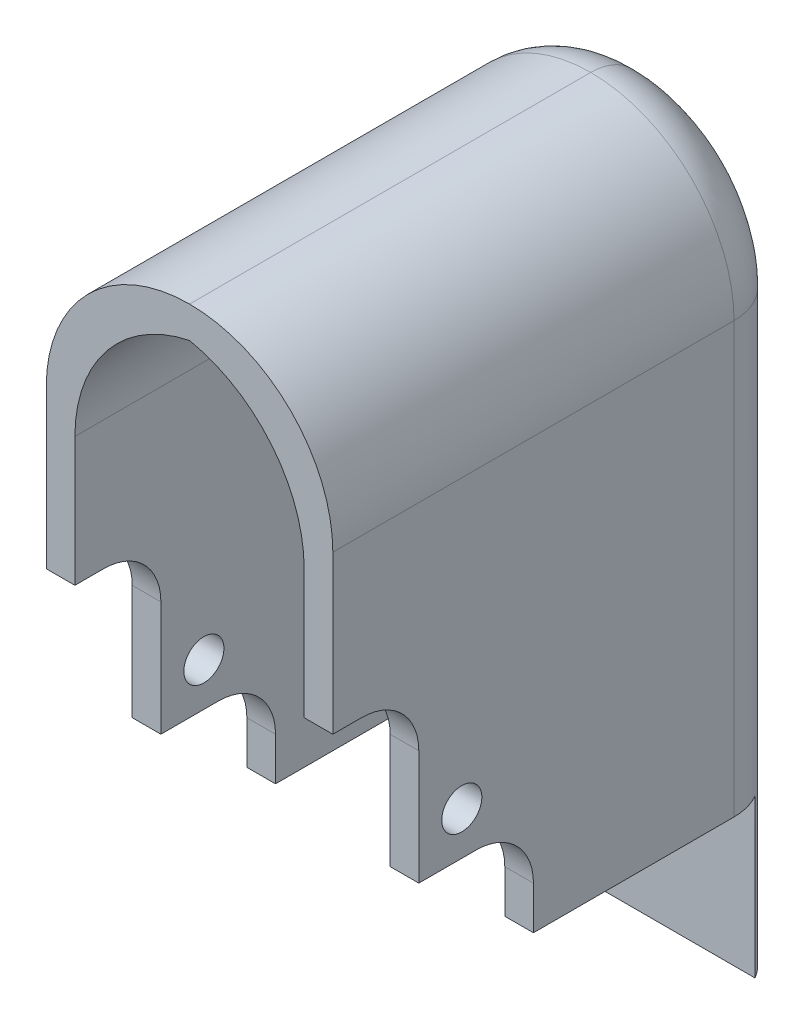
ISO-10303-21;
HEADER;
FILE_DESCRIPTION(('STEP AP214'),'2;1');
FILE_NAME('part.step','',(''),(''),'','','');
FILE_SCHEMA(('AUTOMOTIVE_DESIGN { 1 0 10303 214 1 1 1 1 }'));
ENDSEC;
DATA;
#1=APPLICATION_CONTEXT('core data for automotive mechanical design processes');
#2=APPLICATION_PROTOCOL_DEFINITION('international standard','automotive_design',2000,#1);
#3=PRODUCT_CONTEXT('',#1,'mechanical');
#4=PRODUCT('Part','Part','',(#3));
#5=PRODUCT_RELATED_PRODUCT_CATEGORY('part','',(#4));
#6=PRODUCT_DEFINITION_FORMATION('','',#4);
#7=PRODUCT_DEFINITION_CONTEXT('part definition',#1,'design');
#8=PRODUCT_DEFINITION('design','',#6,#7);
#9=PRODUCT_DEFINITION_SHAPE('','',#8);
#10=(LENGTH_UNIT() NAMED_UNIT(*) SI_UNIT(.MILLI.,.METRE.));
#11=(NAMED_UNIT(*) PLANE_ANGLE_UNIT() SI_UNIT($,.RADIAN.));
#12=(NAMED_UNIT(*) SI_UNIT($,.STERADIAN.) SOLID_ANGLE_UNIT());
#13=UNCERTAINTY_MEASURE_WITH_UNIT(LENGTH_MEASURE(1.E-05),#10,'distance_accuracy_value','');
#14=(GEOMETRIC_REPRESENTATION_CONTEXT(3) GLOBAL_UNCERTAINTY_ASSIGNED_CONTEXT((#13)) GLOBAL_UNIT_ASSIGNED_CONTEXT((#10,
#11,#12)) REPRESENTATION_CONTEXT('',''));
#15=CARTESIAN_POINT('',(0.,0.,0.));
#16=DIRECTION('',(0.,0.,1.));
#17=DIRECTION('',(1.,0.,0.));
#18=AXIS2_PLACEMENT_3D('',#15,#16,#17);
#19=CARTESIAN_POINT('',(0.,0.,-1.));
#20=DIRECTION('',(-1.,0.,0.));
#21=DIRECTION('',(0.,0.,1.));
#22=AXIS2_PLACEMENT_3D('',#19,#20,#21);
#23=PLANE('',#22);
#24=CARTESIAN_POINT('',(0.,9.5,10.5));
#25=DIRECTION('',(-1.,0.,0.));
#26=DIRECTION('',(0.,0.,1.));
#27=AXIS2_PLACEMENT_3D('',#24,#25,#26);
#28=CIRCLE('',#27,0.699999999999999);
#29=CARTESIAN_POINT('',(0.,10.2,10.5));
#30=VERTEX_POINT('',#29);
#31=EDGE_CURVE('E264',#30,#30,#28,.T.);
#32=ORIENTED_EDGE('',*,*,#31,.T.);
#33=EDGE_LOOP('',(#32));
#34=FACE_BOUND('',#33,.T.);
#35=DIRECTION('',(0.,-1.,0.));
#36=VECTOR('',#35,1.);
#37=CARTESIAN_POINT('',(0.,23.5,0.));
#38=LINE('',#37,#36);
#39=CARTESIAN_POINT('',(0.,18.5,0.));
#40=VERTEX_POINT('',#39);
#41=CARTESIAN_POINT('',(0.,4.5,0.));
#42=VERTEX_POINT('',#41);
#43=EDGE_CURVE('E214',#40,#42,#38,.T.);
#44=ORIENTED_EDGE('',*,*,#43,.F.);
#45=DIRECTION('',(0.,0.,1.));
#46=VECTOR('',#45,1.);
#47=CARTESIAN_POINT('',(0.,18.5,15.));
#48=LINE('',#47,#46);
#49=CARTESIAN_POINT('',(0.,18.5,15.));
#50=VERTEX_POINT('',#49);
#51=EDGE_CURVE('E372',#40,#50,#48,.T.);
#52=ORIENTED_EDGE('',*,*,#51,.T.);
#53=DIRECTION('',(0.,1.,0.));
#54=VECTOR('',#53,1.);
#55=CARTESIAN_POINT('',(0.,23.5,15.));
#56=LINE('',#55,#54);
#57=CARTESIAN_POINT('',(0.,14.,15.));
#58=VERTEX_POINT('',#57);
#59=EDGE_CURVE('E321',#58,#50,#56,.T.);
#60=ORIENTED_EDGE('',*,*,#59,.F.);
#61=DIRECTION('',(0.,0.,1.));
#62=VECTOR('',#61,1.);
#63=CARTESIAN_POINT('',(0.,14.,12.));
#64=LINE('',#63,#62);
#65=CARTESIAN_POINT('',(0.,14.,14.));
#66=VERTEX_POINT('',#65);
#67=EDGE_CURVE('E300',#66,#58,#64,.T.);
#68=ORIENTED_EDGE('',*,*,#67,.F.);
#69=CARTESIAN_POINT('',(0.,12.,14.));
#70=DIRECTION('',(-1.,0.,0.));
#71=DIRECTION('',(0.,0.,1.));
#72=AXIS2_PLACEMENT_3D('',#69,#70,#71);
#73=CIRCLE('',#72,2.);
#74=CARTESIAN_POINT('',(0.,12.,12.));
#75=VERTEX_POINT('',#74);
#76=EDGE_CURVE('E366',#66,#75,#73,.T.);
#77=ORIENTED_EDGE('',*,*,#76,.T.);
#78=DIRECTION('',(0.,1.,0.));
#79=VECTOR('',#78,1.);
#80=CARTESIAN_POINT('',(0.,0.,12.));
#81=LINE('',#80,#79);
#82=CARTESIAN_POINT('',(0.,8.,12.));
#83=VERTEX_POINT('',#82);
#84=EDGE_CURVE('E296',#83,#75,#81,.T.);
#85=ORIENTED_EDGE('',*,*,#84,.F.);
#86=DIRECTION('',(0.,0.,1.));
#87=VECTOR('',#86,1.);
#88=CARTESIAN_POINT('',(0.,8.,8.));
#89=LINE('',#88,#87);
#90=CARTESIAN_POINT('',(0.,8.,10.));
#91=VERTEX_POINT('',#90);
#92=EDGE_CURVE('E274',#91,#83,#89,.T.);
#93=ORIENTED_EDGE('',*,*,#92,.F.);
#94=CARTESIAN_POINT('',(0.,6.,10.));
#95=DIRECTION('',(-1.,0.,0.));
#96=DIRECTION('',(0.,0.,1.));
#97=AXIS2_PLACEMENT_3D('',#94,#95,#96);
#98=CIRCLE('',#97,2.);
#99=CARTESIAN_POINT('',(0.,6.,8.));
#100=VERTEX_POINT('',#99);
#101=EDGE_CURVE('E370',#91,#100,#98,.T.);
#102=ORIENTED_EDGE('',*,*,#101,.T.);
#103=DIRECTION('',(0.,1.,0.));
#104=VECTOR('',#103,1.);
#105=CARTESIAN_POINT('',(0.,0.,8.));
#106=LINE('',#105,#104);
#107=CARTESIAN_POINT('',(0.,4.5,8.));
#108=VERTEX_POINT('',#107);
#109=EDGE_CURVE('E239',#108,#100,#106,.T.);
#110=ORIENTED_EDGE('',*,*,#109,.F.);
#111=DIRECTION('',(0.,0.,1.));
#112=VECTOR('',#111,1.);
#113=CARTESIAN_POINT('',(0.,4.5,0.));
#114=LINE('',#113,#112);
#115=EDGE_CURVE('E232',#42,#108,#114,.T.);
#116=ORIENTED_EDGE('',*,*,#115,.F.);
#117=EDGE_LOOP('',(#44,#52,#60,#68,#77,#85,#93,#102,#110,#116));
#118=FACE_BOUND('',#117,.T.);
#119=ADVANCED_FACE('F35',(#34,#118),#23,.F.);
#120=CARTESIAN_POINT('',(8.,0.,-1.));
#121=DIRECTION('',(1.,0.,0.));
#122=DIRECTION('',(0.,0.,-1.));
#123=AXIS2_PLACEMENT_3D('',#120,#121,#122);
#124=PLANE('',#123);
#125=CARTESIAN_POINT('',(8.,9.5,10.5));
#126=DIRECTION('',(1.,0.,0.));
#127=DIRECTION('',(0.,0.,-1.));
#128=AXIS2_PLACEMENT_3D('',#125,#126,#127);
#129=CIRCLE('',#128,0.699999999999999);
#130=CARTESIAN_POINT('',(8.,10.2,10.5));
#131=VERTEX_POINT('',#130);
#132=EDGE_CURVE('E259',#131,#131,#129,.T.);
#133=ORIENTED_EDGE('',*,*,#132,.T.);
#134=EDGE_LOOP('',(#133));
#135=FACE_BOUND('',#134,.T.);
#136=DIRECTION('',(0.,-1.,0.));
#137=VECTOR('',#136,1.);
#138=CARTESIAN_POINT('',(8.,0.,15.));
#139=LINE('',#138,#137);
#140=CARTESIAN_POINT('',(8.,18.5,15.));
#141=VERTEX_POINT('',#140);
#142=CARTESIAN_POINT('',(8.,14.,15.));
#143=VERTEX_POINT('',#142);
#144=EDGE_CURVE('E324',#141,#143,#139,.T.);
#145=ORIENTED_EDGE('',*,*,#144,.F.);
#146=DIRECTION('',(0.,0.,1.));
#147=VECTOR('',#146,1.);
#148=CARTESIAN_POINT('',(8.,18.5,0.));
#149=LINE('',#148,#147);
#150=CARTESIAN_POINT('',(8.,18.5,0.));
#151=VERTEX_POINT('',#150);
#152=EDGE_CURVE('E377',#141,#151,#149,.F.);
#153=ORIENTED_EDGE('',*,*,#152,.T.);
#154=DIRECTION('',(0.,-1.,0.));
#155=VECTOR('',#154,1.);
#156=CARTESIAN_POINT('',(8.,23.5,0.));
#157=LINE('',#156,#155);
#158=CARTESIAN_POINT('',(8.,4.5,0.));
#159=VERTEX_POINT('',#158);
#160=EDGE_CURVE('E226',#151,#159,#157,.T.);
#161=ORIENTED_EDGE('',*,*,#160,.T.);
#162=DIRECTION('',(0.,0.,1.));
#163=VECTOR('',#162,1.);
#164=CARTESIAN_POINT('',(8.,4.5,0.));
#165=LINE('',#164,#163);
#166=CARTESIAN_POINT('',(8.,4.5,8.));
#167=VERTEX_POINT('',#166);
#168=EDGE_CURVE('E252',#159,#167,#165,.T.);
#169=ORIENTED_EDGE('',*,*,#168,.T.);
#170=DIRECTION('',(0.,-1.,0.));
#171=VECTOR('',#170,1.);
#172=CARTESIAN_POINT('',(8.,0.,8.));
#173=LINE('',#172,#171);
#174=CARTESIAN_POINT('',(8.,6.,8.));
#175=VERTEX_POINT('',#174);
#176=EDGE_CURVE('E284',#175,#167,#173,.T.);
#177=ORIENTED_EDGE('',*,*,#176,.F.);
#178=CARTESIAN_POINT('',(8.,6.,10.));
#179=DIRECTION('',(1.,0.,0.));
#180=DIRECTION('',(0.,0.,-1.));
#181=AXIS2_PLACEMENT_3D('',#178,#179,#180);
#182=CIRCLE('',#181,2.);
#183=CARTESIAN_POINT('',(8.,8.,10.));
#184=VERTEX_POINT('',#183);
#185=EDGE_CURVE('E355',#175,#184,#182,.T.);
#186=ORIENTED_EDGE('',*,*,#185,.T.);
#187=DIRECTION('',(0.,0.,1.));
#188=VECTOR('',#187,1.);
#189=CARTESIAN_POINT('',(8.,8.,8.));
#190=LINE('',#189,#188);
#191=CARTESIAN_POINT('',(8.,8.,12.));
#192=VERTEX_POINT('',#191);
#193=EDGE_CURVE('E277',#184,#192,#190,.T.);
#194=ORIENTED_EDGE('',*,*,#193,.T.);
#195=DIRECTION('',(0.,-1.,0.));
#196=VECTOR('',#195,1.);
#197=CARTESIAN_POINT('',(8.,0.,12.));
#198=LINE('',#197,#196);
#199=CARTESIAN_POINT('',(8.,12.,12.));
#200=VERTEX_POINT('',#199);
#201=EDGE_CURVE('E312',#200,#192,#198,.T.);
#202=ORIENTED_EDGE('',*,*,#201,.F.);
#203=CARTESIAN_POINT('',(8.,12.,14.));
#204=DIRECTION('',(1.,0.,0.));
#205=DIRECTION('',(0.,0.,-1.));
#206=AXIS2_PLACEMENT_3D('',#203,#204,#205);
#207=CIRCLE('',#206,2.);
#208=CARTESIAN_POINT('',(8.,14.,14.));
#209=VERTEX_POINT('',#208);
#210=EDGE_CURVE('E360',#200,#209,#207,.T.);
#211=ORIENTED_EDGE('',*,*,#210,.T.);
#212=DIRECTION('',(0.,0.,1.));
#213=VECTOR('',#212,1.);
#214=CARTESIAN_POINT('',(8.,14.,12.));
#215=LINE('',#214,#213);
#216=EDGE_CURVE('E303',#209,#143,#215,.T.);
#217=ORIENTED_EDGE('',*,*,#216,.T.);
#218=EDGE_LOOP('',(#145,#153,#161,#169,#177,#186,#194,#202,#211,#217));
#219=FACE_BOUND('',#218,.T.);
#220=ADVANCED_FACE('F508',(#135,#219),#124,.F.);
#221=CARTESIAN_POINT('',(-1.,24.5,-1.));
#222=DIRECTION('',(-1.,0.,0.));
#223=DIRECTION('',(0.,-1.,0.));
#224=AXIS2_PLACEMENT_3D('',#221,#222,#223);
#225=PLANE('',#224);
#226=DIRECTION('',(0.,0.,1.));
#227=VECTOR('',#226,1.);
#228=CARTESIAN_POINT('',(-0.999999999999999,19.5,-1.));
#229=LINE('',#228,#227);
#230=CARTESIAN_POINT('',(-0.999999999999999,19.5,15.));
#231=VERTEX_POINT('',#230);
#232=CARTESIAN_POINT('',(-0.999999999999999,19.5,1.));
#233=VERTEX_POINT('',#232);
#234=EDGE_CURVE('E379',#231,#233,#229,.F.);
#235=ORIENTED_EDGE('',*,*,#234,.T.);
#236=DIRECTION('',(0.,-1.,0.));
#237=VECTOR('',#236,1.);
#238=CARTESIAN_POINT('',(-0.999999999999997,-1.,1.));
#239=LINE('',#238,#237);
#240=CARTESIAN_POINT('',(-0.999999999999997,4.5,1.));
#241=VERTEX_POINT('',#240);
#242=EDGE_CURVE('E392',#233,#241,#239,.T.);
#243=ORIENTED_EDGE('',*,*,#242,.T.);
#244=DIRECTION('',(0.,0.,1.));
#245=VECTOR('',#244,1.);
#246=CARTESIAN_POINT('',(-0.999999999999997,4.5,0.));
#247=LINE('',#246,#245);
#248=CARTESIAN_POINT('',(-0.999999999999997,4.5,8.));
#249=VERTEX_POINT('',#248);
#250=EDGE_CURVE('E240',#241,#249,#247,.T.);
#251=ORIENTED_EDGE('',*,*,#250,.T.);
#252=DIRECTION('',(0.,-1.,0.));
#253=VECTOR('',#252,1.);
#254=CARTESIAN_POINT('',(-0.999999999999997,0.,8.));
#255=LINE('',#254,#253);
#256=CARTESIAN_POINT('',(-0.999999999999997,6.,8.));
#257=VERTEX_POINT('',#256);
#258=EDGE_CURVE('E269',#257,#249,#255,.T.);
#259=ORIENTED_EDGE('',*,*,#258,.F.);
#260=CARTESIAN_POINT('',(-0.999999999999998,6.,10.));
#261=DIRECTION('',(-1.,0.,0.));
#262=DIRECTION('',(0.,-1.,0.));
#263=AXIS2_PLACEMENT_3D('',#260,#261,#262);
#264=CIRCLE('',#263,2.);
#265=CARTESIAN_POINT('',(-0.999999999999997,8.,10.));
#266=VERTEX_POINT('',#265);
#267=EDGE_CURVE('E368',#257,#266,#264,.F.);
#268=ORIENTED_EDGE('',*,*,#267,.T.);
#269=DIRECTION('',(0.,0.,1.));
#270=VECTOR('',#269,1.);
#271=CARTESIAN_POINT('',(-0.999999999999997,8.,8.));
#272=LINE('',#271,#270);
#273=CARTESIAN_POINT('',(-0.999999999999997,8.,12.));
#274=VERTEX_POINT('',#273);
#275=EDGE_CURVE('E278',#266,#274,#272,.T.);
#276=ORIENTED_EDGE('',*,*,#275,.T.);
#277=DIRECTION('',(0.,-1.,0.));
#278=VECTOR('',#277,1.);
#279=CARTESIAN_POINT('',(-0.999999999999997,0.,12.));
#280=LINE('',#279,#278);
#281=CARTESIAN_POINT('',(-0.999999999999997,12.,12.));
#282=VERTEX_POINT('',#281);
#283=EDGE_CURVE('E293',#282,#274,#280,.T.);
#284=ORIENTED_EDGE('',*,*,#283,.F.);
#285=CARTESIAN_POINT('',(-0.999999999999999,12.,14.));
#286=DIRECTION('',(-1.,0.,0.));
#287=DIRECTION('',(0.,-1.,0.));
#288=AXIS2_PLACEMENT_3D('',#285,#286,#287);
#289=CIRCLE('',#288,2.);
#290=CARTESIAN_POINT('',(-0.999999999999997,14.,14.));
#291=VERTEX_POINT('',#290);
#292=EDGE_CURVE('E364',#282,#291,#289,.F.);
#293=ORIENTED_EDGE('',*,*,#292,.T.);
#294=DIRECTION('',(0.,0.,1.));
#295=VECTOR('',#294,1.);
#296=CARTESIAN_POINT('',(-0.999999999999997,14.,12.));
#297=LINE('',#296,#295);
#298=CARTESIAN_POINT('',(-0.999999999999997,14.,15.));
#299=VERTEX_POINT('',#298);
#300=EDGE_CURVE('E304',#291,#299,#297,.T.);
#301=ORIENTED_EDGE('',*,*,#300,.T.);
#302=DIRECTION('',(0.,-1.,0.));
#303=VECTOR('',#302,1.);
#304=CARTESIAN_POINT('',(-1.,24.5,15.));
#305=LINE('',#304,#303);
#306=EDGE_CURVE('E307',#231,#299,#305,.T.);
#307=ORIENTED_EDGE('',*,*,#306,.F.);
#308=EDGE_LOOP('',(#235,#243,#251,#259,#268,#276,#284,#293,#301,#307));
#309=FACE_BOUND('',#308,.T.);
#310=CARTESIAN_POINT('',(-1.,9.5,10.5));
#311=DIRECTION('',(1.,0.,0.));
#312=DIRECTION('',(0.,1.,0.));
#313=AXIS2_PLACEMENT_3D('',#310,#311,#312);
#314=CIRCLE('',#313,0.699999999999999);
#315=CARTESIAN_POINT('',(-1.,10.2,10.5));
#316=VERTEX_POINT('',#315);
#317=EDGE_CURVE('E256',#316,#316,#314,.T.);
#318=ORIENTED_EDGE('',*,*,#317,.T.);
#319=EDGE_LOOP('',(#318));
#320=FACE_BOUND('',#319,.T.);
#321=ADVANCED_FACE('F452',(#309,#320),#225,.T.);
#322=CARTESIAN_POINT('',(9.,24.5,-1.));
#323=DIRECTION('',(1.,0.,0.));
#324=DIRECTION('',(0.,1.,0.));
#325=AXIS2_PLACEMENT_3D('',#322,#323,#324);
#326=PLANE('',#325);
#327=DIRECTION('',(0.,0.,1.));
#328=VECTOR('',#327,1.);
#329=CARTESIAN_POINT('',(9.,4.5,0.));
#330=LINE('',#329,#328);
#331=CARTESIAN_POINT('',(9.,4.5,1.));
#332=VERTEX_POINT('',#331);
#333=CARTESIAN_POINT('',(9.,4.5,8.));
#334=VERTEX_POINT('',#333);
#335=EDGE_CURVE('E248',#332,#334,#330,.T.);
#336=ORIENTED_EDGE('',*,*,#335,.F.);
#337=DIRECTION('',(0.,1.,0.));
#338=VECTOR('',#337,1.);
#339=CARTESIAN_POINT('',(9.,19.5,1.));
#340=LINE('',#339,#338);
#341=CARTESIAN_POINT('',(9.,19.5,1.));
#342=VERTEX_POINT('',#341);
#343=EDGE_CURVE('E416',#332,#342,#340,.T.);
#344=ORIENTED_EDGE('',*,*,#343,.T.);
#345=DIRECTION('',(0.,0.,1.));
#346=VECTOR('',#345,1.);
#347=CARTESIAN_POINT('',(9.,19.5,-1.));
#348=LINE('',#347,#346);
#349=CARTESIAN_POINT('',(9.,19.5,15.));
#350=VERTEX_POINT('',#349);
#351=EDGE_CURVE('E382',#342,#350,#348,.T.);
#352=ORIENTED_EDGE('',*,*,#351,.T.);
#353=DIRECTION('',(0.,1.,0.));
#354=VECTOR('',#353,1.);
#355=CARTESIAN_POINT('',(9.00000000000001,0.,15.));
#356=LINE('',#355,#354);
#357=CARTESIAN_POINT('',(9.,14.,15.));
#358=VERTEX_POINT('',#357);
#359=EDGE_CURVE('E326',#358,#350,#356,.T.);
#360=ORIENTED_EDGE('',*,*,#359,.F.);
#361=DIRECTION('',(0.,0.,1.));
#362=VECTOR('',#361,1.);
#363=CARTESIAN_POINT('',(8.99999999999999,14.,12.));
#364=LINE('',#363,#362);
#365=CARTESIAN_POINT('',(8.99999999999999,14.,14.));
#366=VERTEX_POINT('',#365);
#367=EDGE_CURVE('E314',#366,#358,#364,.T.);
#368=ORIENTED_EDGE('',*,*,#367,.F.);
#369=CARTESIAN_POINT('',(9.,12.,14.));
#370=DIRECTION('',(1.,0.,0.));
#371=DIRECTION('',(0.,1.,0.));
#372=AXIS2_PLACEMENT_3D('',#369,#370,#371);
#373=CIRCLE('',#372,2.);
#374=CARTESIAN_POINT('',(8.99999999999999,12.,12.));
#375=VERTEX_POINT('',#374);
#376=EDGE_CURVE('E362',#366,#375,#373,.F.);
#377=ORIENTED_EDGE('',*,*,#376,.T.);
#378=DIRECTION('',(0.,1.,0.));
#379=VECTOR('',#378,1.);
#380=CARTESIAN_POINT('',(9.,0.,12.));
#381=LINE('',#380,#379);
#382=CARTESIAN_POINT('',(9.,8.,12.));
#383=VERTEX_POINT('',#382);
#384=EDGE_CURVE('E309',#383,#375,#381,.T.);
#385=ORIENTED_EDGE('',*,*,#384,.F.);
#386=DIRECTION('',(0.,0.,1.));
#387=VECTOR('',#386,1.);
#388=CARTESIAN_POINT('',(9.,8.,8.));
#389=LINE('',#388,#387);
#390=CARTESIAN_POINT('',(9.,8.,10.));
#391=VERTEX_POINT('',#390);
#392=EDGE_CURVE('E287',#391,#383,#389,.T.);
#393=ORIENTED_EDGE('',*,*,#392,.F.);
#394=CARTESIAN_POINT('',(9.,6.,10.));
#395=DIRECTION('',(1.,0.,0.));
#396=DIRECTION('',(0.,1.,0.));
#397=AXIS2_PLACEMENT_3D('',#394,#395,#396);
#398=CIRCLE('',#397,2.);
#399=CARTESIAN_POINT('',(9.,6.,8.));
#400=VERTEX_POINT('',#399);
#401=EDGE_CURVE('E357',#391,#400,#398,.F.);
#402=ORIENTED_EDGE('',*,*,#401,.T.);
#403=DIRECTION('',(0.,1.,0.));
#404=VECTOR('',#403,1.);
#405=CARTESIAN_POINT('',(9.,0.,8.));
#406=LINE('',#405,#404);
#407=EDGE_CURVE('E282',#334,#400,#406,.T.);
#408=ORIENTED_EDGE('',*,*,#407,.F.);
#409=EDGE_LOOP('',(#336,#344,#352,#360,#368,#377,#385,#393,#402,#408));
#410=FACE_BOUND('',#409,.T.);
#411=CARTESIAN_POINT('',(9.,9.5,10.5));
#412=DIRECTION('',(1.,0.,0.));
#413=DIRECTION('',(0.,1.,0.));
#414=AXIS2_PLACEMENT_3D('',#411,#412,#413);
#415=CIRCLE('',#414,0.699999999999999);
#416=CARTESIAN_POINT('',(9.,10.2,10.5));
#417=VERTEX_POINT('',#416);
#418=EDGE_CURVE('E242',#417,#417,#415,.T.);
#419=ORIENTED_EDGE('',*,*,#418,.F.);
#420=EDGE_LOOP('',(#419));
#421=FACE_BOUND('',#420,.T.);
#422=ADVANCED_FACE('F495',(#410,#421),#326,.T.);
#423=CARTESIAN_POINT('',(-0.999999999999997,-1.,-1.));
#424=DIRECTION('',(0.,-1.,0.));
#425=DIRECTION('',(0.,0.,-1.));
#426=AXIS2_PLACEMENT_3D('',#423,#424,#425);
#427=PLANE('',#426);
#428=DIRECTION('',(1.,0.,0.));
#429=VECTOR('',#428,1.);
#430=CARTESIAN_POINT('',(-0.999999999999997,-1.,0.));
#431=LINE('',#430,#429);
#432=CARTESIAN_POINT('',(-0.732050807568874,-1.,0.));
#433=VERTEX_POINT('',#432);
#434=CARTESIAN_POINT('',(8.73205080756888,-1.,0.));
#435=VERTEX_POINT('',#434);
#436=EDGE_CURVE('E329',#433,#435,#431,.T.);
#437=ORIENTED_EDGE('',*,*,#436,.F.);
#438=CARTESIAN_POINT('',(1.,-1.,1.));
#439=DIRECTION('',(0.,-1.,0.));
#440=DIRECTION('',(0.,0.,-1.));
#441=AXIS2_PLACEMENT_3D('',#438,#439,#440);
#442=CIRCLE('',#441,2.);
#443=CARTESIAN_POINT('',(1.,-1.,-1.));
#444=VERTEX_POINT('',#443);
#445=EDGE_CURVE('E406',#433,#444,#442,.T.);
#446=ORIENTED_EDGE('',*,*,#445,.T.);
#447=DIRECTION('',(1.,0.,0.));
#448=VECTOR('',#447,1.);
#449=CARTESIAN_POINT('',(-0.999999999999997,-1.,-1.));
#450=LINE('',#449,#448);
#451=CARTESIAN_POINT('',(7.,-1.,-1.));
#452=VERTEX_POINT('',#451);
#453=EDGE_CURVE('E330',#444,#452,#450,.T.);
#454=ORIENTED_EDGE('',*,*,#453,.T.);
#455=CARTESIAN_POINT('',(7.,-1.,1.));
#456=DIRECTION('',(0.,-1.,0.));
#457=DIRECTION('',(0.,0.,-1.));
#458=AXIS2_PLACEMENT_3D('',#455,#456,#457);
#459=CIRCLE('',#458,2.);
#460=EDGE_CURVE('E404',#452,#435,#459,.T.);
#461=ORIENTED_EDGE('',*,*,#460,.T.);
#462=EDGE_LOOP('',(#437,#446,#454,#461));
#463=FACE_BOUND('',#462,.T.);
#464=ADVANCED_FACE('F444',(#463),#427,.T.);
#465=CARTESIAN_POINT('',(0.,0.,-1.));
#466=DIRECTION('',(0.,0.,1.));
#467=DIRECTION('',(1.,0.,0.));
#468=AXIS2_PLACEMENT_3D('',#465,#466,#467);
#469=PLANE('',#468);
#470=ORIENTED_EDGE('',*,*,#453,.F.);
#471=DIRECTION('',(0.,-1.,0.));
#472=VECTOR('',#471,1.);
#473=CARTESIAN_POINT('',(1.,19.5,-1.));
#474=LINE('',#473,#472);
#475=CARTESIAN_POINT('',(1.,19.5,-1.));
#476=VERTEX_POINT('',#475);
#477=EDGE_CURVE('E414',#444,#476,#474,.F.);
#478=ORIENTED_EDGE('',*,*,#477,.T.);
#479=CARTESIAN_POINT('',(4.,19.5,-1.));
#480=DIRECTION('',(0.,0.,1.));
#481=DIRECTION('',(1.,0.,0.));
#482=AXIS2_PLACEMENT_3D('',#479,#480,#481);
#483=CIRCLE('',#482,3.);
#484=CARTESIAN_POINT('',(4.,22.5,-1.));
#485=VERTEX_POINT('',#484);
#486=EDGE_CURVE('E408',#476,#485,#483,.F.);
#487=ORIENTED_EDGE('',*,*,#486,.T.);
#488=CARTESIAN_POINT('',(4.,19.5,-1.));
#489=DIRECTION('',(0.,0.,1.));
#490=DIRECTION('',(1.,0.,0.));
#491=AXIS2_PLACEMENT_3D('',#488,#489,#490);
#492=CIRCLE('',#491,3.);
#493=CARTESIAN_POINT('',(7.,19.5,-1.));
#494=VERTEX_POINT('',#493);
#495=EDGE_CURVE('E410',#485,#494,#492,.F.);
#496=ORIENTED_EDGE('',*,*,#495,.T.);
#497=DIRECTION('',(0.,1.,0.));
#498=VECTOR('',#497,1.);
#499=CARTESIAN_POINT('',(7.,-1.,-1.));
#500=LINE('',#499,#498);
#501=EDGE_CURVE('E412',#494,#452,#500,.F.);
#502=ORIENTED_EDGE('',*,*,#501,.T.);
#503=EDGE_LOOP('',(#470,#478,#487,#496,#502));
#504=FACE_BOUND('',#503,.T.);
#505=ADVANCED_FACE('F440',(#504),#469,.F.);
#506=CARTESIAN_POINT('',(0.,0.,0.));
#507=DIRECTION('',(0.,0.,1.));
#508=DIRECTION('',(1.,0.,0.));
#509=AXIS2_PLACEMENT_3D('',#506,#507,#508);
#510=PLANE('',#509);
#511=DIRECTION('',(-1.,0.,0.));
#512=VECTOR('',#511,1.);
#513=CARTESIAN_POINT('',(-0.999999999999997,4.5,0.));
#514=LINE('',#513,#512);
#515=CARTESIAN_POINT('',(-0.732050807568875,4.5,0.));
#516=VERTEX_POINT('',#515);
#517=EDGE_CURVE('E217',#42,#516,#514,.T.);
#518=ORIENTED_EDGE('',*,*,#517,.T.);
#519=DIRECTION('',(0.,1.,0.));
#520=VECTOR('',#519,1.);
#521=CARTESIAN_POINT('',(-0.732050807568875,4.5,0.));
#522=LINE('',#521,#520);
#523=EDGE_CURVE('E402',#516,#433,#522,.F.);
#524=ORIENTED_EDGE('',*,*,#523,.T.);
#525=ORIENTED_EDGE('',*,*,#436,.T.);
#526=DIRECTION('',(0.,-1.,0.));
#527=VECTOR('',#526,1.);
#528=CARTESIAN_POINT('',(8.73205080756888,-1.,0.));
#529=LINE('',#528,#527);
#530=CARTESIAN_POINT('',(8.73205080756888,4.5,0.));
#531=VERTEX_POINT('',#530);
#532=EDGE_CURVE('E400',#435,#531,#529,.F.);
#533=ORIENTED_EDGE('',*,*,#532,.T.);
#534=DIRECTION('',(-1.,0.,0.));
#535=VECTOR('',#534,1.);
#536=CARTESIAN_POINT('',(9.,4.5,0.));
#537=LINE('',#536,#535);
#538=EDGE_CURVE('E246',#531,#159,#537,.T.);
#539=ORIENTED_EDGE('',*,*,#538,.T.);
#540=ORIENTED_EDGE('',*,*,#160,.F.);
#541=CARTESIAN_POINT('',(3.,18.5,0.));
#542=DIRECTION('',(0.,0.,1.));
#543=DIRECTION('',(1.,0.,0.));
#544=AXIS2_PLACEMENT_3D('',#541,#542,#543);
#545=CIRCLE('',#544,5.);
#546=CARTESIAN_POINT('',(4.,23.3989794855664,0.));
#547=VERTEX_POINT('',#546);
#548=EDGE_CURVE('E374',#151,#547,#545,.T.);
#549=ORIENTED_EDGE('',*,*,#548,.T.);
#550=CARTESIAN_POINT('',(5.,18.5,0.));
#551=DIRECTION('',(0.,0.,1.));
#552=DIRECTION('',(1.,0.,0.));
#553=AXIS2_PLACEMENT_3D('',#550,#551,#552);
#554=CIRCLE('',#553,5.);
#555=EDGE_CURVE('E220',#547,#40,#554,.T.);
#556=ORIENTED_EDGE('',*,*,#555,.T.);
#557=ORIENTED_EDGE('',*,*,#43,.T.);
#558=EDGE_LOOP('',(#518,#524,#525,#533,#539,#540,#549,#556,#557));
#559=FACE_BOUND('',#558,.T.);
#560=ADVANCED_FACE('F216',(#559),#510,.T.);
#561=CARTESIAN_POINT('',(0.,0.,15.));
#562=DIRECTION('',(0.,0.,1.));
#563=DIRECTION('',(1.,0.,0.));
#564=AXIS2_PLACEMENT_3D('',#561,#562,#563);
#565=PLANE('',#564);
#566=CARTESIAN_POINT('',(4.,19.5,15.));
#567=DIRECTION('',(0.,0.,1.));
#568=DIRECTION('',(1.,0.,0.));
#569=AXIS2_PLACEMENT_3D('',#566,#567,#568);
#570=CIRCLE('',#569,5.);
#571=CARTESIAN_POINT('',(4.,24.5,15.));
#572=VERTEX_POINT('',#571);
#573=EDGE_CURVE('E388',#350,#572,#570,.T.);
#574=ORIENTED_EDGE('',*,*,#573,.T.);
#575=CARTESIAN_POINT('',(4.,19.5,15.));
#576=DIRECTION('',(0.,0.,1.));
#577=DIRECTION('',(1.,0.,0.));
#578=AXIS2_PLACEMENT_3D('',#575,#576,#577);
#579=CIRCLE('',#578,5.);
#580=EDGE_CURVE('E390',#572,#231,#579,.T.);
#581=ORIENTED_EDGE('',*,*,#580,.T.);
#582=ORIENTED_EDGE('',*,*,#306,.T.);
#583=DIRECTION('',(-1.,0.,0.));
#584=VECTOR('',#583,1.);
#585=CARTESIAN_POINT('',(-0.999999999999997,14.,15.));
#586=LINE('',#585,#584);
#587=EDGE_CURVE('E297',#58,#299,#586,.T.);
#588=ORIENTED_EDGE('',*,*,#587,.F.);
#589=ORIENTED_EDGE('',*,*,#59,.T.);
#590=CARTESIAN_POINT('',(5.,18.5,15.));
#591=DIRECTION('',(0.,0.,1.));
#592=DIRECTION('',(1.,0.,0.));
#593=AXIS2_PLACEMENT_3D('',#590,#591,#592);
#594=CIRCLE('',#593,5.);
#595=CARTESIAN_POINT('',(4.,23.3989794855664,15.));
#596=VERTEX_POINT('',#595);
#597=EDGE_CURVE('E384',#50,#596,#594,.F.);
#598=ORIENTED_EDGE('',*,*,#597,.T.);
#599=CARTESIAN_POINT('',(3.,18.5,15.));
#600=DIRECTION('',(0.,0.,1.));
#601=DIRECTION('',(1.,0.,0.));
#602=AXIS2_PLACEMENT_3D('',#599,#600,#601);
#603=CIRCLE('',#602,5.);
#604=EDGE_CURVE('E386',#596,#141,#603,.F.);
#605=ORIENTED_EDGE('',*,*,#604,.T.);
#606=ORIENTED_EDGE('',*,*,#144,.T.);
#607=DIRECTION('',(-1.,0.,0.));
#608=VECTOR('',#607,1.);
#609=CARTESIAN_POINT('',(8.99999999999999,14.,15.));
#610=LINE('',#609,#608);
#611=EDGE_CURVE('E280',#358,#143,#610,.T.);
#612=ORIENTED_EDGE('',*,*,#611,.F.);
#613=ORIENTED_EDGE('',*,*,#359,.T.);
#614=EDGE_LOOP('',(#574,#581,#582,#588,#589,#598,#605,#606,#612,#613));
#615=FACE_BOUND('',#614,.T.);
#616=ADVANCED_FACE('F485',(#615),#565,.T.);
#617=CARTESIAN_POINT('',(8.99999999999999,14.,12.));
#618=DIRECTION('',(0.,1.,0.));
#619=DIRECTION('',(0.,0.,1.));
#620=AXIS2_PLACEMENT_3D('',#617,#618,#619);
#621=PLANE('',#620);
#622=ORIENTED_EDGE('',*,*,#216,.F.);
#623=DIRECTION('',(-1.,0.,0.));
#624=VECTOR('',#623,1.);
#625=CARTESIAN_POINT('',(8.99999999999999,14.,14.));
#626=LINE('',#625,#624);
#627=EDGE_CURVE('E343',#209,#366,#626,.F.);
#628=ORIENTED_EDGE('',*,*,#627,.T.);
#629=ORIENTED_EDGE('',*,*,#367,.T.);
#630=ORIENTED_EDGE('',*,*,#611,.T.);
#631=EDGE_LOOP('',(#622,#628,#629,#630));
#632=FACE_BOUND('',#631,.T.);
#633=ADVANCED_FACE('F523',(#632),#621,.F.);
#634=CARTESIAN_POINT('',(0.,0.,12.));
#635=DIRECTION('',(0.,0.,1.));
#636=DIRECTION('',(1.,0.,0.));
#637=AXIS2_PLACEMENT_3D('',#634,#635,#636);
#638=PLANE('',#637);
#639=ORIENTED_EDGE('',*,*,#384,.T.);
#640=DIRECTION('',(-1.,0.,0.));
#641=VECTOR('',#640,1.);
#642=CARTESIAN_POINT('',(0.,12.,12.));
#643=LINE('',#642,#641);
#644=EDGE_CURVE('E340',#375,#200,#643,.T.);
#645=ORIENTED_EDGE('',*,*,#644,.T.);
#646=ORIENTED_EDGE('',*,*,#201,.T.);
#647=DIRECTION('',(-1.,0.,0.));
#648=VECTOR('',#647,1.);
#649=CARTESIAN_POINT('',(9.,8.,12.));
#650=LINE('',#649,#648);
#651=EDGE_CURVE('E225',#383,#192,#650,.T.);
#652=ORIENTED_EDGE('',*,*,#651,.F.);
#653=EDGE_LOOP('',(#639,#645,#646,#652));
#654=FACE_BOUND('',#653,.T.);
#655=ADVANCED_FACE('F531',(#654),#638,.T.);
#656=CARTESIAN_POINT('',(-0.999999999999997,14.,12.));
#657=DIRECTION('',(0.,1.,0.));
#658=DIRECTION('',(0.,0.,1.));
#659=AXIS2_PLACEMENT_3D('',#656,#657,#658);
#660=PLANE('',#659);
#661=ORIENTED_EDGE('',*,*,#300,.F.);
#662=DIRECTION('',(-1.,0.,0.));
#663=VECTOR('',#662,1.);
#664=CARTESIAN_POINT('',(0.,14.,14.));
#665=LINE('',#664,#663);
#666=EDGE_CURVE('E348',#291,#66,#665,.F.);
#667=ORIENTED_EDGE('',*,*,#666,.T.);
#668=ORIENTED_EDGE('',*,*,#67,.T.);
#669=ORIENTED_EDGE('',*,*,#587,.T.);
#670=EDGE_LOOP('',(#661,#667,#668,#669));
#671=FACE_BOUND('',#670,.T.);
#672=ADVANCED_FACE('F478',(#671),#660,.F.);
#673=CARTESIAN_POINT('',(0.,0.,12.));
#674=DIRECTION('',(0.,0.,-1.));
#675=DIRECTION('',(-1.,0.,0.));
#676=AXIS2_PLACEMENT_3D('',#673,#674,#675);
#677=PLANE('',#676);
#678=ORIENTED_EDGE('',*,*,#84,.T.);
#679=DIRECTION('',(-1.,0.,0.));
#680=VECTOR('',#679,1.);
#681=CARTESIAN_POINT('',(-0.999999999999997,12.,12.));
#682=LINE('',#681,#680);
#683=EDGE_CURVE('E345',#75,#282,#682,.T.);
#684=ORIENTED_EDGE('',*,*,#683,.T.);
#685=ORIENTED_EDGE('',*,*,#283,.T.);
#686=DIRECTION('',(-1.,0.,0.));
#687=VECTOR('',#686,1.);
#688=CARTESIAN_POINT('',(-0.999999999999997,8.,12.));
#689=LINE('',#688,#687);
#690=EDGE_CURVE('E272',#83,#274,#689,.T.);
#691=ORIENTED_EDGE('',*,*,#690,.F.);
#692=EDGE_LOOP('',(#678,#684,#685,#691));
#693=FACE_BOUND('',#692,.T.);
#694=ADVANCED_FACE('F472',(#693),#677,.F.);
#695=CARTESIAN_POINT('',(-0.999999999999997,8.,8.));
#696=DIRECTION('',(0.,1.,0.));
#697=DIRECTION('',(0.,0.,1.));
#698=AXIS2_PLACEMENT_3D('',#695,#696,#697);
#699=PLANE('',#698);
#700=ORIENTED_EDGE('',*,*,#275,.F.);
#701=DIRECTION('',(-1.,0.,0.));
#702=VECTOR('',#701,1.);
#703=CARTESIAN_POINT('',(0.,8.,10.));
#704=LINE('',#703,#702);
#705=EDGE_CURVE('E353',#266,#91,#704,.F.);
#706=ORIENTED_EDGE('',*,*,#705,.T.);
#707=ORIENTED_EDGE('',*,*,#92,.T.);
#708=ORIENTED_EDGE('',*,*,#690,.T.);
#709=EDGE_LOOP('',(#700,#706,#707,#708));
#710=FACE_BOUND('',#709,.T.);
#711=ADVANCED_FACE('F465',(#710),#699,.F.);
#712=CARTESIAN_POINT('',(0.,0.,8.));
#713=DIRECTION('',(0.,0.,-1.));
#714=DIRECTION('',(-1.,0.,0.));
#715=AXIS2_PLACEMENT_3D('',#712,#713,#714);
#716=PLANE('',#715);
#717=ORIENTED_EDGE('',*,*,#258,.T.);
#718=DIRECTION('',(-1.,0.,0.));
#719=VECTOR('',#718,1.);
#720=CARTESIAN_POINT('',(-0.999999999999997,4.5,8.));
#721=LINE('',#720,#719);
#722=EDGE_CURVE('E235',#108,#249,#721,.T.);
#723=ORIENTED_EDGE('',*,*,#722,.F.);
#724=ORIENTED_EDGE('',*,*,#109,.T.);
#725=DIRECTION('',(-1.,0.,0.));
#726=VECTOR('',#725,1.);
#727=CARTESIAN_POINT('',(-0.999999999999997,6.,8.));
#728=LINE('',#727,#726);
#729=EDGE_CURVE('E350',#100,#257,#728,.T.);
#730=ORIENTED_EDGE('',*,*,#729,.T.);
#731=EDGE_LOOP('',(#717,#723,#724,#730));
#732=FACE_BOUND('',#731,.T.);
#733=ADVANCED_FACE('F458',(#732),#716,.F.);
#734=CARTESIAN_POINT('',(9.,8.,8.));
#735=DIRECTION('',(0.,1.,0.));
#736=DIRECTION('',(0.,0.,1.));
#737=AXIS2_PLACEMENT_3D('',#734,#735,#736);
#738=PLANE('',#737);
#739=ORIENTED_EDGE('',*,*,#193,.F.);
#740=DIRECTION('',(-1.,0.,0.));
#741=VECTOR('',#740,1.);
#742=CARTESIAN_POINT('',(9.,8.,10.));
#743=LINE('',#742,#741);
#744=EDGE_CURVE('E338',#184,#391,#743,.F.);
#745=ORIENTED_EDGE('',*,*,#744,.T.);
#746=ORIENTED_EDGE('',*,*,#392,.T.);
#747=ORIENTED_EDGE('',*,*,#651,.T.);
#748=EDGE_LOOP('',(#739,#745,#746,#747));
#749=FACE_BOUND('',#748,.T.);
#750=ADVANCED_FACE('F533',(#749),#738,.F.);
#751=CARTESIAN_POINT('',(0.,0.,8.));
#752=DIRECTION('',(0.,0.,1.));
#753=DIRECTION('',(1.,0.,0.));
#754=AXIS2_PLACEMENT_3D('',#751,#752,#753);
#755=PLANE('',#754);
#756=DIRECTION('',(-1.,0.,0.));
#757=VECTOR('',#756,1.);
#758=CARTESIAN_POINT('',(9.,4.5,8.));
#759=LINE('',#758,#757);
#760=EDGE_CURVE('E249',#334,#167,#759,.T.);
#761=ORIENTED_EDGE('',*,*,#760,.F.);
#762=ORIENTED_EDGE('',*,*,#407,.T.);
#763=DIRECTION('',(-1.,0.,0.));
#764=VECTOR('',#763,1.);
#765=CARTESIAN_POINT('',(0.,6.,8.));
#766=LINE('',#765,#764);
#767=EDGE_CURVE('E333',#400,#175,#766,.T.);
#768=ORIENTED_EDGE('',*,*,#767,.T.);
#769=ORIENTED_EDGE('',*,*,#176,.T.);
#770=EDGE_LOOP('',(#761,#762,#768,#769));
#771=FACE_BOUND('',#770,.T.);
#772=ADVANCED_FACE('F503',(#771),#755,.T.);
#773=CARTESIAN_POINT('',(0.,6.,10.));
#774=DIRECTION('',(-1.,0.,0.));
#775=DIRECTION('',(0.,0.,1.));
#776=AXIS2_PLACEMENT_3D('',#773,#774,#775);
#777=CYLINDRICAL_SURFACE('',#776,2.);
#778=ORIENTED_EDGE('',*,*,#401,.F.);
#779=ORIENTED_EDGE('',*,*,#744,.F.);
#780=ORIENTED_EDGE('',*,*,#185,.F.);
#781=ORIENTED_EDGE('',*,*,#767,.F.);
#782=EDGE_LOOP('',(#778,#779,#780,#781));
#783=FACE_BOUND('',#782,.T.);
#784=ADVANCED_FACE('F537',(#783),#777,.F.);
#785=CARTESIAN_POINT('',(0.,12.,14.));
#786=DIRECTION('',(-1.,0.,0.));
#787=DIRECTION('',(0.,0.,1.));
#788=AXIS2_PLACEMENT_3D('',#785,#786,#787);
#789=CYLINDRICAL_SURFACE('',#788,2.);
#790=ORIENTED_EDGE('',*,*,#376,.F.);
#791=ORIENTED_EDGE('',*,*,#627,.F.);
#792=ORIENTED_EDGE('',*,*,#210,.F.);
#793=ORIENTED_EDGE('',*,*,#644,.F.);
#794=EDGE_LOOP('',(#790,#791,#792,#793));
#795=FACE_BOUND('',#794,.T.);
#796=ADVANCED_FACE('F525',(#795),#789,.F.);
#797=CARTESIAN_POINT('',(0.,12.,14.));
#798=DIRECTION('',(1.,0.,0.));
#799=DIRECTION('',(0.,0.,-1.));
#800=AXIS2_PLACEMENT_3D('',#797,#798,#799);
#801=CYLINDRICAL_SURFACE('',#800,2.);
#802=ORIENTED_EDGE('',*,*,#76,.F.);
#803=ORIENTED_EDGE('',*,*,#666,.F.);
#804=ORIENTED_EDGE('',*,*,#292,.F.);
#805=ORIENTED_EDGE('',*,*,#683,.F.);
#806=EDGE_LOOP('',(#802,#803,#804,#805));
#807=FACE_BOUND('',#806,.T.);
#808=ADVANCED_FACE('F482',(#807),#801,.F.);
#809=CARTESIAN_POINT('',(0.,6.,10.));
#810=DIRECTION('',(1.,0.,0.));
#811=DIRECTION('',(0.,0.,-1.));
#812=AXIS2_PLACEMENT_3D('',#809,#810,#811);
#813=CYLINDRICAL_SURFACE('',#812,2.);
#814=ORIENTED_EDGE('',*,*,#101,.F.);
#815=ORIENTED_EDGE('',*,*,#705,.F.);
#816=ORIENTED_EDGE('',*,*,#267,.F.);
#817=ORIENTED_EDGE('',*,*,#729,.F.);
#818=EDGE_LOOP('',(#814,#815,#816,#817));
#819=FACE_BOUND('',#818,.T.);
#820=ADVANCED_FACE('F469',(#819),#813,.F.);
#821=CARTESIAN_POINT('',(-1.,9.5,10.5));
#822=DIRECTION('',(1.,0.,0.));
#823=DIRECTION('',(0.,1.,0.));
#824=AXIS2_PLACEMENT_3D('',#821,#822,#823);
#825=CYLINDRICAL_SURFACE('',#824,0.699999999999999);
#826=CARTESIAN_POINT('',(9.,10.2,10.5));
#827=CARTESIAN_POINT('',(8.98958333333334,10.2,10.5));
#828=CARTESIAN_POINT('',(8.97916666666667,10.2,10.5));
#829=CARTESIAN_POINT('',(8.95833333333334,10.2,10.5));
#830=CARTESIAN_POINT('',(8.94791666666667,10.2,10.5));
#831=CARTESIAN_POINT('',(8.92708333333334,10.2,10.5));
#832=CARTESIAN_POINT('',(8.91666666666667,10.2,10.5));
#833=CARTESIAN_POINT('',(8.89583333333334,10.2,10.5));
#834=CARTESIAN_POINT('',(8.88541666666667,10.2,10.5));
#835=CARTESIAN_POINT('',(8.86458333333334,10.2,10.5));
#836=CARTESIAN_POINT('',(8.85416666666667,10.2,10.5));
#837=CARTESIAN_POINT('',(8.83333333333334,10.2,10.5));
#838=CARTESIAN_POINT('',(8.82291666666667,10.2,10.5));
#839=CARTESIAN_POINT('',(8.80208333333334,10.2,10.5));
#840=CARTESIAN_POINT('',(8.79166666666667,10.2,10.5));
#841=CARTESIAN_POINT('',(8.77083333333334,10.2,10.5));
#842=CARTESIAN_POINT('',(8.76041666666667,10.2,10.5));
#843=CARTESIAN_POINT('',(8.73958333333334,10.2,10.5));
#844=CARTESIAN_POINT('',(8.72916666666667,10.2,10.5));
#845=CARTESIAN_POINT('',(8.70833333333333,10.2,10.5));
#846=CARTESIAN_POINT('',(8.69791666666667,10.2,10.5));
#847=CARTESIAN_POINT('',(8.67708333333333,10.2,10.5));
#848=CARTESIAN_POINT('',(8.66666666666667,10.2,10.5));
#849=CARTESIAN_POINT('',(8.64583333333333,10.2,10.5));
#850=CARTESIAN_POINT('',(8.63541666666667,10.2,10.5));
#851=CARTESIAN_POINT('',(8.61458333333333,10.2,10.5));
#852=CARTESIAN_POINT('',(8.60416666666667,10.2,10.5));
#853=CARTESIAN_POINT('',(8.58333333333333,10.2,10.5));
#854=CARTESIAN_POINT('',(8.57291666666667,10.2,10.5));
#855=CARTESIAN_POINT('',(8.55208333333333,10.2,10.5));
#856=CARTESIAN_POINT('',(8.54166666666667,10.2,10.5));
#857=CARTESIAN_POINT('',(8.52083333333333,10.2,10.5));
#858=CARTESIAN_POINT('',(8.51041666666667,10.2,10.5));
#859=CARTESIAN_POINT('',(8.48958333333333,10.2,10.5));
#860=CARTESIAN_POINT('',(8.47916666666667,10.2,10.5));
#861=CARTESIAN_POINT('',(8.45833333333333,10.2,10.5));
#862=CARTESIAN_POINT('',(8.44791666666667,10.2,10.5));
#863=CARTESIAN_POINT('',(8.42708333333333,10.2,10.5));
#864=CARTESIAN_POINT('',(8.41666666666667,10.2,10.5));
#865=CARTESIAN_POINT('',(8.39583333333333,10.2,10.5));
#866=CARTESIAN_POINT('',(8.38541666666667,10.2,10.5));
#867=CARTESIAN_POINT('',(8.36458333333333,10.2,10.5));
#868=CARTESIAN_POINT('',(8.35416666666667,10.2,10.5));
#869=CARTESIAN_POINT('',(8.33333333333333,10.2,10.5));
#870=CARTESIAN_POINT('',(8.32291666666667,10.2,10.5));
#871=CARTESIAN_POINT('',(8.30208333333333,10.2,10.5));
#872=CARTESIAN_POINT('',(8.29166666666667,10.2,10.5));
#873=CARTESIAN_POINT('',(8.27083333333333,10.2,10.5));
#874=CARTESIAN_POINT('',(8.26041666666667,10.2,10.5));
#875=CARTESIAN_POINT('',(8.23958333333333,10.2,10.5));
#876=CARTESIAN_POINT('',(8.22916666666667,10.2,10.5));
#877=CARTESIAN_POINT('',(8.20833333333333,10.2,10.5));
#878=CARTESIAN_POINT('',(8.19791666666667,10.2,10.5));
#879=CARTESIAN_POINT('',(8.17708333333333,10.2,10.5));
#880=CARTESIAN_POINT('',(8.16666666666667,10.2,10.5));
#881=CARTESIAN_POINT('',(8.14583333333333,10.2,10.5));
#882=CARTESIAN_POINT('',(8.13541666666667,10.2,10.5));
#883=CARTESIAN_POINT('',(8.11458333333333,10.2,10.5));
#884=CARTESIAN_POINT('',(8.10416666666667,10.2,10.5));
#885=CARTESIAN_POINT('',(8.08333333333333,10.2,10.5));
#886=CARTESIAN_POINT('',(8.07291666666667,10.2,10.5));
#887=CARTESIAN_POINT('',(8.05208333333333,10.2,10.5));
#888=CARTESIAN_POINT('',(8.04166666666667,10.2,10.5));
#889=CARTESIAN_POINT('',(8.02083333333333,10.2,10.5));
#890=CARTESIAN_POINT('',(8.01041666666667,10.2,10.5));
#891=CARTESIAN_POINT('',(8.,10.2,10.5));
#892=B_SPLINE_CURVE_WITH_KNOTS('',3,(#826,#827,#828,#829,#830,#831,#832,#833,#834,#835,#836,
#837,#838,#839,#840,#841,#842,#843,#844,#845,#846,#847,#848,#849,#850,#851,#852,#853,#854,#855,
#856,#857,#858,#859,#860,#861,#862,#863,#864,#865,#866,#867,#868,#869,#870,#871,#872,#873,#874,
#875,#876,#877,#878,#879,#880,#881,#882,#883,#884,#885,#886,#887,#888,#889,#890,#891),
.UNSPECIFIED.,.F.,.F.,(4,2,2,2,2,2,2,2,2,2,2,2,2,2,2,2,2,2,2,2,2,2,2,2,2,2,2,2,2,2,2,2,4),(0.,
0.03125,0.0625000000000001,0.0937500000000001,0.125,0.15625,0.1875,0.21875,0.25,
0.281250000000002,0.312500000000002,0.343750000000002,0.375000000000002,0.406250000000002,
0.437500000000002,0.468750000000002,0.500000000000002,0.531250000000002,0.562500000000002,
0.593750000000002,0.625000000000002,0.656250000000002,0.687500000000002,0.718750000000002,
0.750000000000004,0.781250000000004,0.812500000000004,0.843750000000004,0.875000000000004,
0.906250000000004,0.937500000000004,0.968750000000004,1.),.UNSPECIFIED.);
#893=EDGE_CURVE('BSEAM661',#417,#131,#892,.T.);
#894=ORIENTED_EDGE('',*,*,#418,.T.);
#895=ORIENTED_EDGE('',*,*,#132,.F.);
#896=ORIENTED_EDGE('',*,*,#893,.T.);
#897=ORIENTED_EDGE('',*,*,#893,.F.);
#898=EDGE_LOOP('',(#894,#896,#895,#897));
#899=FACE_BOUND('',#898,.T.);
#900=ADVANCED_FACE('F661',(#899),#825,.F.);
#901=CARTESIAN_POINT('',(-1.,10.2,10.5));
#902=CARTESIAN_POINT('',(-0.989583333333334,10.2,10.5));
#903=CARTESIAN_POINT('',(-0.979166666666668,10.2,10.5));
#904=CARTESIAN_POINT('',(-0.958333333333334,10.2,10.5));
#905=CARTESIAN_POINT('',(-0.947916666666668,10.2,10.5));
#906=CARTESIAN_POINT('',(-0.927083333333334,10.2,10.5));
#907=CARTESIAN_POINT('',(-0.916666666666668,10.2,10.5));
#908=CARTESIAN_POINT('',(-0.895833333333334,10.2,10.5));
#909=CARTESIAN_POINT('',(-0.885416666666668,10.2,10.5));
#910=CARTESIAN_POINT('',(-0.864583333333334,10.2,10.5));
#911=CARTESIAN_POINT('',(-0.854166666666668,10.2,10.5));
#912=CARTESIAN_POINT('',(-0.833333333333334,10.2,10.5));
#913=CARTESIAN_POINT('',(-0.822916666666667,10.2,10.5));
#914=CARTESIAN_POINT('',(-0.802083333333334,10.2,10.5));
#915=CARTESIAN_POINT('',(-0.791666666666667,10.2,10.5));
#916=CARTESIAN_POINT('',(-0.770833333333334,10.2,10.5));
#917=CARTESIAN_POINT('',(-0.760416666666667,10.2,10.5));
#918=CARTESIAN_POINT('',(-0.739583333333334,10.2,10.5));
#919=CARTESIAN_POINT('',(-0.729166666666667,10.2,10.5));
#920=CARTESIAN_POINT('',(-0.708333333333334,10.2,10.5));
#921=CARTESIAN_POINT('',(-0.697916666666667,10.2,10.5));
#922=CARTESIAN_POINT('',(-0.677083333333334,10.2,10.5));
#923=CARTESIAN_POINT('',(-0.666666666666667,10.2,10.5));
#924=CARTESIAN_POINT('',(-0.645833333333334,10.2,10.5));
#925=CARTESIAN_POINT('',(-0.635416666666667,10.2,10.5));
#926=CARTESIAN_POINT('',(-0.614583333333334,10.2,10.5));
#927=CARTESIAN_POINT('',(-0.604166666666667,10.2,10.5));
#928=CARTESIAN_POINT('',(-0.583333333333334,10.2,10.5));
#929=CARTESIAN_POINT('',(-0.572916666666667,10.2,10.5));
#930=CARTESIAN_POINT('',(-0.552083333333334,10.2,10.5));
#931=CARTESIAN_POINT('',(-0.541666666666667,10.2,10.5));
#932=CARTESIAN_POINT('',(-0.520833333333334,10.2,10.5));
#933=CARTESIAN_POINT('',(-0.510416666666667,10.2,10.5));
#934=CARTESIAN_POINT('',(-0.489583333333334,10.2,10.5));
#935=CARTESIAN_POINT('',(-0.479166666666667,10.2,10.5));
#936=CARTESIAN_POINT('',(-0.458333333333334,10.2,10.5));
#937=CARTESIAN_POINT('',(-0.447916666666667,10.2,10.5));
#938=CARTESIAN_POINT('',(-0.427083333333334,10.2,10.5));
#939=CARTESIAN_POINT('',(-0.416666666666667,10.2,10.5));
#940=CARTESIAN_POINT('',(-0.395833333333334,10.2,10.5));
#941=CARTESIAN_POINT('',(-0.385416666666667,10.2,10.5));
#942=CARTESIAN_POINT('',(-0.364583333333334,10.2,10.5));
#943=CARTESIAN_POINT('',(-0.354166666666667,10.2,10.5));
#944=CARTESIAN_POINT('',(-0.333333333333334,10.2,10.5));
#945=CARTESIAN_POINT('',(-0.322916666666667,10.2,10.5));
#946=CARTESIAN_POINT('',(-0.302083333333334,10.2,10.5));
#947=CARTESIAN_POINT('',(-0.291666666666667,10.2,10.5));
#948=CARTESIAN_POINT('',(-0.270833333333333,10.2,10.5));
#949=CARTESIAN_POINT('',(-0.260416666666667,10.2,10.5));
#950=CARTESIAN_POINT('',(-0.239583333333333,10.2,10.5));
#951=CARTESIAN_POINT('',(-0.229166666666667,10.2,10.5));
#952=CARTESIAN_POINT('',(-0.208333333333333,10.2,10.5));
#953=CARTESIAN_POINT('',(-0.197916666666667,10.2,10.5));
#954=CARTESIAN_POINT('',(-0.177083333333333,10.2,10.5));
#955=CARTESIAN_POINT('',(-0.166666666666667,10.2,10.5));
#956=CARTESIAN_POINT('',(-0.145833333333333,10.2,10.5));
#957=CARTESIAN_POINT('',(-0.135416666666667,10.2,10.5));
#958=CARTESIAN_POINT('',(-0.114583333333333,10.2,10.5));
#959=CARTESIAN_POINT('',(-0.104166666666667,10.2,10.5));
#960=CARTESIAN_POINT('',(-0.0833333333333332,10.2,10.5));
#961=CARTESIAN_POINT('',(-0.0729166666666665,10.2,10.5));
#962=CARTESIAN_POINT('',(-0.0520833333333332,10.2,10.5));
#963=CARTESIAN_POINT('',(-0.0416666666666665,10.2,10.5));
#964=CARTESIAN_POINT('',(-0.0208333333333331,10.2,10.5));
#965=CARTESIAN_POINT('',(-0.0104166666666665,10.2,10.5));
#966=CARTESIAN_POINT('',(0.,10.2,10.5));
#967=B_SPLINE_CURVE_WITH_KNOTS('',3,(#901,#902,#903,#904,#905,#906,#907,#908,#909,#910,#911,
#912,#913,#914,#915,#916,#917,#918,#919,#920,#921,#922,#923,#924,#925,#926,#927,#928,#929,#930,
#931,#932,#933,#934,#935,#936,#937,#938,#939,#940,#941,#942,#943,#944,#945,#946,#947,#948,#949,
#950,#951,#952,#953,#954,#955,#956,#957,#958,#959,#960,#961,#962,#963,#964,#965,#966),
.UNSPECIFIED.,.F.,.F.,(4,2,2,2,2,2,2,2,2,2,2,2,2,2,2,2,2,2,2,2,2,2,2,2,2,2,2,2,2,2,2,2,4),(0.,
0.0312499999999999,0.0624999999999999,0.09375,0.125,0.15625,0.1875,0.21875,0.25,0.28125,0.3125,
0.34375,0.375,0.40625,0.4375,0.46875,0.5,0.53125,0.5625,0.593750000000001,0.625000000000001,
0.656250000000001,0.687500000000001,0.718750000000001,0.750000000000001,0.781250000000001,
0.812500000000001,0.843750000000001,0.875000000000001,0.906250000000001,0.937500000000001,
0.968750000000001,1.),.UNSPECIFIED.);
#968=EDGE_CURVE('BSEAM597',#316,#30,#967,.T.);
#969=ORIENTED_EDGE('',*,*,#317,.F.);
#970=ORIENTED_EDGE('',*,*,#31,.F.);
#971=ORIENTED_EDGE('',*,*,#968,.T.);
#972=ORIENTED_EDGE('',*,*,#968,.F.);
#973=EDGE_LOOP('',(#969,#971,#970,#972));
#974=FACE_BOUND('',#973,.T.);
#975=ADVANCED_FACE('F597',(#974),#825,.F.);
#976=CARTESIAN_POINT('',(9.,4.5,0.));
#977=DIRECTION('',(0.,1.,0.));
#978=DIRECTION('',(0.,0.,1.));
#979=AXIS2_PLACEMENT_3D('',#976,#977,#978);
#980=PLANE('',#979);
#981=ORIENTED_EDGE('',*,*,#538,.F.);
#982=CARTESIAN_POINT('',(7.,4.5,1.));
#983=DIRECTION('',(0.,1.,0.));
#984=DIRECTION('',(0.,0.,1.));
#985=AXIS2_PLACEMENT_3D('',#982,#983,#984);
#986=CIRCLE('',#985,2.);
#987=EDGE_CURVE('E59',#531,#332,#986,.F.);
#988=ORIENTED_EDGE('',*,*,#987,.T.);
#989=ORIENTED_EDGE('',*,*,#335,.T.);
#990=ORIENTED_EDGE('',*,*,#760,.T.);
#991=ORIENTED_EDGE('',*,*,#168,.F.);
#992=EDGE_LOOP('',(#981,#988,#989,#990,#991));
#993=FACE_BOUND('',#992,.T.);
#994=ADVANCED_FACE('F500',(#993),#980,.F.);
#995=CARTESIAN_POINT('',(-0.999999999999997,4.5,0.));
#996=DIRECTION('',(0.,1.,0.));
#997=DIRECTION('',(0.,0.,1.));
#998=AXIS2_PLACEMENT_3D('',#995,#996,#997);
#999=PLANE('',#998);
#1000=ORIENTED_EDGE('',*,*,#250,.F.);
#1001=CARTESIAN_POINT('',(1.,4.5,1.));
#1002=DIRECTION('',(0.,1.,0.));
#1003=DIRECTION('',(0.,0.,1.));
#1004=AXIS2_PLACEMENT_3D('',#1001,#1002,#1003);
#1005=CIRCLE('',#1004,2.);
#1006=EDGE_CURVE('E234',#241,#516,#1005,.F.);
#1007=ORIENTED_EDGE('',*,*,#1006,.T.);
#1008=ORIENTED_EDGE('',*,*,#517,.F.);
#1009=ORIENTED_EDGE('',*,*,#115,.T.);
#1010=ORIENTED_EDGE('',*,*,#722,.T.);
#1011=EDGE_LOOP('',(#1000,#1007,#1008,#1009,#1010));
#1012=FACE_BOUND('',#1011,.T.);
#1013=ADVANCED_FACE('F230',(#1012),#999,.F.);
#1014=CARTESIAN_POINT('',(3.,18.5,-1.));
#1015=DIRECTION('',(0.,0.,-1.));
#1016=DIRECTION('',(-1.,0.,0.));
#1017=AXIS2_PLACEMENT_3D('',#1014,#1015,#1016);
#1018=CYLINDRICAL_SURFACE('',#1017,5.);
#1019=DIRECTION('',(0.,0.,-1.));
#1020=VECTOR('',#1019,1.);
#1021=CARTESIAN_POINT('',(4.,23.3989794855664,7.5));
#1022=LINE('',#1021,#1020);
#1023=EDGE_CURVE('E251',#547,#596,#1022,.F.);
#1024=ORIENTED_EDGE('',*,*,#1023,.F.);
#1025=ORIENTED_EDGE('',*,*,#548,.F.);
#1026=ORIENTED_EDGE('',*,*,#152,.F.);
#1027=ORIENTED_EDGE('',*,*,#604,.F.);
#1028=EDGE_LOOP('',(#1024,#1025,#1026,#1027));
#1029=FACE_BOUND('',#1028,.T.);
#1030=ADVANCED_FACE('F515',(#1029),#1018,.F.);
#1031=CARTESIAN_POINT('',(5.,18.5,-1.));
#1032=DIRECTION('',(0.,0.,-1.));
#1033=DIRECTION('',(-1.,0.,0.));
#1034=AXIS2_PLACEMENT_3D('',#1031,#1032,#1033);
#1035=CYLINDRICAL_SURFACE('',#1034,5.);
#1036=ORIENTED_EDGE('',*,*,#555,.F.);
#1037=ORIENTED_EDGE('',*,*,#1023,.T.);
#1038=ORIENTED_EDGE('',*,*,#597,.F.);
#1039=ORIENTED_EDGE('',*,*,#51,.F.);
#1040=EDGE_LOOP('',(#1036,#1037,#1038,#1039));
#1041=FACE_BOUND('',#1040,.T.);
#1042=ADVANCED_FACE('F518',(#1041),#1035,.F.);
#1043=CARTESIAN_POINT('',(4.,19.5,-1.));
#1044=DIRECTION('',(0.,0.,1.));
#1045=DIRECTION('',(1.,0.,0.));
#1046=AXIS2_PLACEMENT_3D('',#1043,#1044,#1045);
#1047=CYLINDRICAL_SURFACE('',#1046,5.);
#1048=ORIENTED_EDGE('',*,*,#351,.F.);
#1049=CARTESIAN_POINT('',(4.,19.5,1.));
#1050=DIRECTION('',(0.,0.,1.));
#1051=DIRECTION('',(1.,0.,0.));
#1052=AXIS2_PLACEMENT_3D('',#1049,#1050,#1051);
#1053=CIRCLE('',#1052,5.);
#1054=CARTESIAN_POINT('',(4.,24.5,1.));
#1055=VERTEX_POINT('',#1054);
#1056=EDGE_CURVE('E44',#342,#1055,#1053,.T.);
#1057=ORIENTED_EDGE('',*,*,#1056,.T.);
#1058=DIRECTION('',(0.,0.,1.));
#1059=VECTOR('',#1058,1.);
#1060=CARTESIAN_POINT('',(4.,24.5,-1.));
#1061=LINE('',#1060,#1059);
#1062=EDGE_CURVE('E395',#572,#1055,#1061,.F.);
#1063=ORIENTED_EDGE('',*,*,#1062,.F.);
#1064=ORIENTED_EDGE('',*,*,#573,.F.);
#1065=EDGE_LOOP('',(#1048,#1057,#1063,#1064));
#1066=FACE_BOUND('',#1065,.T.);
#1067=ADVANCED_FACE('F490',(#1066),#1047,.T.);
#1068=CARTESIAN_POINT('',(4.,19.5,-1.));
#1069=DIRECTION('',(0.,0.,1.));
#1070=DIRECTION('',(1.,0.,0.));
#1071=AXIS2_PLACEMENT_3D('',#1068,#1069,#1070);
#1072=CYLINDRICAL_SURFACE('',#1071,5.);
#1073=ORIENTED_EDGE('',*,*,#1062,.T.);
#1074=CARTESIAN_POINT('',(4.,19.5,1.));
#1075=DIRECTION('',(0.,0.,1.));
#1076=DIRECTION('',(1.,0.,0.));
#1077=AXIS2_PLACEMENT_3D('',#1074,#1075,#1076);
#1078=CIRCLE('',#1077,5.);
#1079=EDGE_CURVE('E11',#1055,#233,#1078,.T.);
#1080=ORIENTED_EDGE('',*,*,#1079,.T.);
#1081=ORIENTED_EDGE('',*,*,#234,.F.);
#1082=ORIENTED_EDGE('',*,*,#580,.F.);
#1083=EDGE_LOOP('',(#1073,#1080,#1081,#1082));
#1084=FACE_BOUND('',#1083,.T.);
#1085=ADVANCED_FACE('F488',(#1084),#1072,.T.);
#1086=CARTESIAN_POINT('',(7.,24.5,1.));
#1087=DIRECTION('',(0.,-1.,0.));
#1088=DIRECTION('',(1.,0.,0.));
#1089=AXIS2_PLACEMENT_3D('',#1086,#1087,#1088);
#1090=CYLINDRICAL_SURFACE('',#1089,2.);
#1091=ORIENTED_EDGE('',*,*,#460,.F.);
#1092=ORIENTED_EDGE('',*,*,#501,.F.);
#1093=CARTESIAN_POINT('',(7.,19.5,1.));
#1094=DIRECTION('',(0.,1.,0.));
#1095=DIRECTION('',(0.,0.,1.));
#1096=AXIS2_PLACEMENT_3D('',#1093,#1094,#1095);
#1097=CIRCLE('',#1096,2.);
#1098=EDGE_CURVE('E39',#342,#494,#1097,.T.);
#1099=ORIENTED_EDGE('',*,*,#1098,.F.);
#1100=ORIENTED_EDGE('',*,*,#343,.F.);
#1101=ORIENTED_EDGE('',*,*,#987,.F.);
#1102=ORIENTED_EDGE('',*,*,#532,.F.);
#1103=EDGE_LOOP('',(#1091,#1092,#1099,#1100,#1101,#1102));
#1104=FACE_BOUND('',#1103,.T.);
#1105=ADVANCED_FACE('F37',(#1104),#1090,.T.);
#1106=CARTESIAN_POINT('',(4.,19.5,1.));
#1107=DIRECTION('',(0.,0.,1.));
#1108=DIRECTION('',(1.,0.,0.));
#1109=AXIS2_PLACEMENT_3D('',#1106,#1107,#1108);
#1110=TOROIDAL_SURFACE('',#1109,3.,2.);
#1111=ORIENTED_EDGE('',*,*,#1098,.T.);
#1112=ORIENTED_EDGE('',*,*,#495,.F.);
#1113=CARTESIAN_POINT('',(4.,22.5,1.));
#1114=DIRECTION('',(-1.,0.,0.));
#1115=DIRECTION('',(0.,0.,1.));
#1116=AXIS2_PLACEMENT_3D('',#1113,#1114,#1115);
#1117=CIRCLE('',#1116,2.);
#1118=EDGE_CURVE('E422',#1055,#485,#1117,.T.);
#1119=ORIENTED_EDGE('',*,*,#1118,.F.);
#1120=ORIENTED_EDGE('',*,*,#1056,.F.);
#1121=EDGE_LOOP('',(#1111,#1112,#1119,#1120));
#1122=FACE_BOUND('',#1121,.T.);
#1123=ADVANCED_FACE('F432',(#1122),#1110,.T.);
#1124=CARTESIAN_POINT('',(4.,19.5,1.));
#1125=DIRECTION('',(0.,0.,1.));
#1126=DIRECTION('',(1.,0.,0.));
#1127=AXIS2_PLACEMENT_3D('',#1124,#1125,#1126);
#1128=TOROIDAL_SURFACE('',#1127,3.,2.);
#1129=ORIENTED_EDGE('',*,*,#1118,.T.);
#1130=ORIENTED_EDGE('',*,*,#486,.F.);
#1131=CARTESIAN_POINT('',(1.,19.5,1.));
#1132=DIRECTION('',(0.,-1.,0.));
#1133=DIRECTION('',(0.,0.,-1.));
#1134=AXIS2_PLACEMENT_3D('',#1131,#1132,#1133);
#1135=CIRCLE('',#1134,2.);
#1136=EDGE_CURVE('E420',#233,#476,#1135,.T.);
#1137=ORIENTED_EDGE('',*,*,#1136,.F.);
#1138=ORIENTED_EDGE('',*,*,#1079,.F.);
#1139=EDGE_LOOP('',(#1129,#1130,#1137,#1138));
#1140=FACE_BOUND('',#1139,.T.);
#1141=ADVANCED_FACE('F450',(#1140),#1128,.T.);
#1142=CARTESIAN_POINT('',(1.,24.5,1.));
#1143=DIRECTION('',(0.,1.,0.));
#1144=DIRECTION('',(-1.,0.,0.));
#1145=AXIS2_PLACEMENT_3D('',#1142,#1143,#1144);
#1146=CYLINDRICAL_SURFACE('',#1145,2.);
#1147=ORIENTED_EDGE('',*,*,#1136,.T.);
#1148=ORIENTED_EDGE('',*,*,#477,.F.);
#1149=ORIENTED_EDGE('',*,*,#445,.F.);
#1150=ORIENTED_EDGE('',*,*,#523,.F.);
#1151=ORIENTED_EDGE('',*,*,#1006,.F.);
#1152=ORIENTED_EDGE('',*,*,#242,.F.);
#1153=EDGE_LOOP('',(#1147,#1148,#1149,#1150,#1151,#1152));
#1154=FACE_BOUND('',#1153,.T.);
#1155=ADVANCED_FACE('F447',(#1154),#1146,.T.);
#1156=CLOSED_SHELL('',(#119,#220,#321,#422,#464,#505,#560,#616,#633,#655,#672,#694,#711,#733,
#750,#772,#784,#796,#808,#820,#900,#975,#994,#1013,#1030,#1042,#1067,#1085,#1105,#1123,#1141,#1155));
#1157=MANIFOLD_SOLID_BREP('B2',#1156);
#1158=ADVANCED_BREP_SHAPE_REPRESENTATION('',(#18,#1157),#14);
#1159=SHAPE_DEFINITION_REPRESENTATION(#9,#1158);
ENDSEC;
END-ISO-10303-21;
